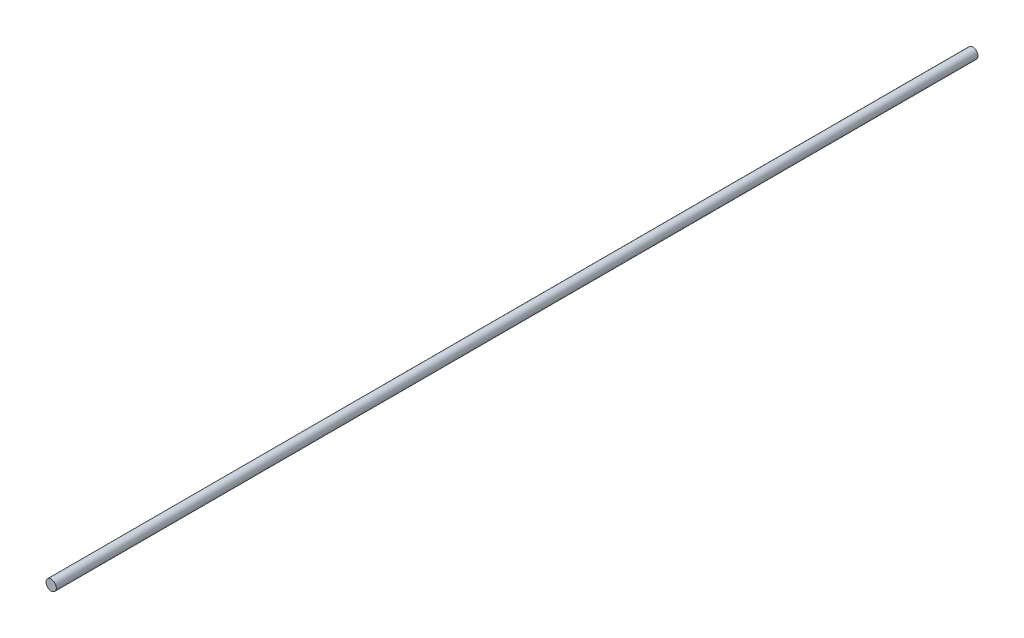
from build123d import *

# Parameters (mm, degrees)
SKETCH1_R           = 30
BOSS_EXTRUDE1_DEPTH = 5350


with BuildPart() as part:
    # Sketch1 → Boss-Extrude1 (new body)
    with BuildSketch(Plane.XY):
        Circle(SKETCH1_R)
    extrude(amount=-BOSS_EXTRUDE1_DEPTH)


solid = part.part
